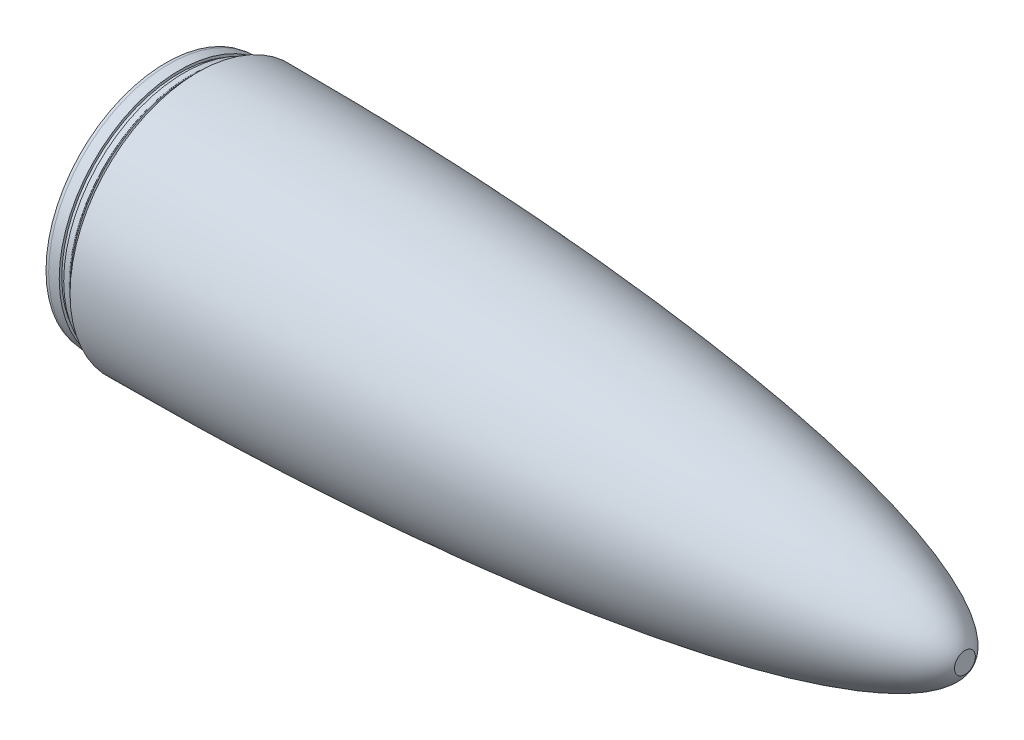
ISO-10303-21;
HEADER;
FILE_DESCRIPTION(('STEP AP214'),'2;1');
FILE_NAME('part.step','',(''),(''),'','','');
FILE_SCHEMA(('AUTOMOTIVE_DESIGN { 1 0 10303 214 1 1 1 1 }'));
ENDSEC;
DATA;
#1=APPLICATION_CONTEXT('core data for automotive mechanical design processes');
#2=APPLICATION_PROTOCOL_DEFINITION('international standard','automotive_design',2000,#1);
#3=PRODUCT_CONTEXT('',#1,'mechanical');
#4=PRODUCT('Part','Part','',(#3));
#5=PRODUCT_RELATED_PRODUCT_CATEGORY('part','',(#4));
#6=PRODUCT_DEFINITION_FORMATION('','',#4);
#7=PRODUCT_DEFINITION_CONTEXT('part definition',#1,'design');
#8=PRODUCT_DEFINITION('design','',#6,#7);
#9=PRODUCT_DEFINITION_SHAPE('','',#8);
#10=(LENGTH_UNIT() NAMED_UNIT(*) SI_UNIT(.MILLI.,.METRE.));
#11=(NAMED_UNIT(*) PLANE_ANGLE_UNIT() SI_UNIT($,.RADIAN.));
#12=(NAMED_UNIT(*) SI_UNIT($,.STERADIAN.) SOLID_ANGLE_UNIT());
#13=UNCERTAINTY_MEASURE_WITH_UNIT(LENGTH_MEASURE(1.E-05),#10,'distance_accuracy_value','');
#14=(GEOMETRIC_REPRESENTATION_CONTEXT(3) GLOBAL_UNCERTAINTY_ASSIGNED_CONTEXT((#13)) GLOBAL_UNIT_ASSIGNED_CONTEXT((#10,
#11,#12)) REPRESENTATION_CONTEXT('',''));
#15=CARTESIAN_POINT('',(0.,0.,0.));
#16=DIRECTION('',(0.,0.,1.));
#17=DIRECTION('',(1.,0.,0.));
#18=AXIS2_PLACEMENT_3D('',#15,#16,#17);
#19=CARTESIAN_POINT('',(-25.4,0.,0.));
#20=DIRECTION('',(-1.,0.,0.));
#21=DIRECTION('',(0.,0.,1.));
#22=AXIS2_PLACEMENT_3D('',#19,#20,#21);
#23=PLANE('',#22);
#24=CARTESIAN_POINT('',(-25.4,0.,0.));
#25=DIRECTION('',(-1.,0.,0.));
#26=DIRECTION('',(0.,0.,1.));
#27=AXIS2_PLACEMENT_3D('',#24,#25,#26);
#28=CIRCLE('',#27,94.996);
#29=CARTESIAN_POINT('',(-25.4,0.,94.996));
#30=VERTEX_POINT('',#29);
#31=EDGE_CURVE('E44',#30,#30,#28,.T.);
#32=ORIENTED_EDGE('',*,*,#31,.T.);
#33=EDGE_LOOP('',(#32));
#34=FACE_BOUND('',#33,.T.);
#35=CARTESIAN_POINT('',(-25.4,0.,0.));
#36=DIRECTION('',(-1.,0.,0.));
#37=DIRECTION('',(0.,0.,1.));
#38=AXIS2_PLACEMENT_3D('',#35,#36,#37);
#39=CIRCLE('',#38,87.63);
#40=CARTESIAN_POINT('',(-25.4,0.,87.63));
#41=VERTEX_POINT('',#40);
#42=EDGE_CURVE('E87',#41,#41,#39,.T.);
#43=ORIENTED_EDGE('',*,*,#42,.F.);
#44=EDGE_LOOP('',(#43));
#45=FACE_BOUND('',#44,.T.);
#46=ADVANCED_FACE('F32',(#34,#45),#23,.T.);
#47=CARTESIAN_POINT('',(577.85,0.,0.));
#48=DIRECTION('',(-1.,0.,0.));
#49=DIRECTION('',(0.,0.,1.));
#50=AXIS2_PLACEMENT_3D('',#47,#48,#49);
#51=PLANE('',#50);
#52=CARTESIAN_POINT('',(577.85,0.,0.));
#53=DIRECTION('',(-1.,0.,0.));
#54=DIRECTION('',(0.,0.,1.));
#55=AXIS2_PLACEMENT_3D('',#52,#53,#54);
#56=CIRCLE('',#55,26.341576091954);
#57=CARTESIAN_POINT('',(577.85,0.,26.341576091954));
#58=VERTEX_POINT('',#57);
#59=EDGE_CURVE('E69',#58,#58,#56,.T.);
#60=ORIENTED_EDGE('',*,*,#59,.T.);
#61=EDGE_LOOP('',(#60));
#62=FACE_BOUND('',#61,.T.);
#63=ADVANCED_FACE('F97',(#62),#51,.T.);
#64=CARTESIAN_POINT('',(0.,0.,0.));
#65=DIRECTION('',(0.,0.,-1.));
#66=DIRECTION('',(1.,0.,0.));
#67=AXIS2_PLACEMENT_3D('',#64,#65,#66);
#68=ELLIPSE('',#67,601.98,93.98);
#69=TRIMMED_CURVE('',#68,(PARAMETER_VALUE(0.)),(PARAMETER_VALUE(3.14159265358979)),.T.,.PARAMETER.);
#70=CARTESIAN_POINT('',(0.,0.,0.));
#71=DIRECTION('',(-1.,0.,0.));
#72=AXIS1_PLACEMENT('',#70,#71);
#73=SURFACE_OF_REVOLUTION('',#69,#72);
#74=CARTESIAN_POINT('',(217.522088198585,0.,0.));
#75=DIRECTION('',(-1.,0.,0.));
#76=DIRECTION('',(0.,0.,1.));
#77=AXIS2_PLACEMENT_3D('',#74,#75,#76);
#78=CIRCLE('',#77,87.63);
#79=CARTESIAN_POINT('',(217.522088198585,0.,87.63));
#80=VERTEX_POINT('',#79);
#81=EDGE_CURVE('E72',#80,#80,#78,.T.);
#82=ORIENTED_EDGE('',*,*,#81,.T.);
#83=EDGE_LOOP('',(#82));
#84=FACE_BOUND('',#83,.T.);
#85=ORIENTED_EDGE('',*,*,#59,.F.);
#86=EDGE_LOOP('',(#85));
#87=FACE_BOUND('',#86,.T.);
#88=ADVANCED_FACE('F92',(#84,#87),#73,.F.);
#89=CARTESIAN_POINT('',(0.,0.,0.));
#90=DIRECTION('',(-1.,0.,0.));
#91=DIRECTION('',(0.,0.,1.));
#92=AXIS2_PLACEMENT_3D('',#89,#90,#91);
#93=CYLINDRICAL_SURFACE('',#92,87.63);
#94=CARTESIAN_POINT('',(165.1,0.,0.));
#95=DIRECTION('',(-1.,0.,0.));
#96=DIRECTION('',(0.,0.,1.));
#97=AXIS2_PLACEMENT_3D('',#94,#95,#96);
#98=CIRCLE('',#97,87.63);
#99=CARTESIAN_POINT('',(165.1,0.,87.63));
#100=VERTEX_POINT('',#99);
#101=EDGE_CURVE('E75',#100,#100,#98,.T.);
#102=ORIENTED_EDGE('',*,*,#101,.T.);
#103=EDGE_LOOP('',(#102));
#104=FACE_BOUND('',#103,.T.);
#105=ORIENTED_EDGE('',*,*,#81,.F.);
#106=EDGE_LOOP('',(#105));
#107=FACE_BOUND('',#106,.T.);
#108=ADVANCED_FACE('F96',(#104,#107),#93,.F.);
#109=CARTESIAN_POINT('',(165.1,0.,0.));
#110=DIRECTION('',(-1.,0.,0.));
#111=DIRECTION('',(0.,0.,1.));
#112=AXIS2_PLACEMENT_3D('',#109,#110,#111);
#113=CONICAL_SURFACE('',#112,87.63,0.756834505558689);
#114=CARTESIAN_POINT('',(160.528,0.,0.));
#115=DIRECTION('',(-1.,0.,0.));
#116=DIRECTION('',(0.,0.,1.));
#117=AXIS2_PLACEMENT_3D('',#114,#115,#116);
#118=CIRCLE('',#117,91.948);
#119=CARTESIAN_POINT('',(160.528,0.,91.948));
#120=VERTEX_POINT('',#119);
#121=EDGE_CURVE('E78',#120,#120,#118,.T.);
#122=ORIENTED_EDGE('',*,*,#121,.T.);
#123=EDGE_LOOP('',(#122));
#124=FACE_BOUND('',#123,.T.);
#125=ORIENTED_EDGE('',*,*,#101,.F.);
#126=EDGE_LOOP('',(#125));
#127=FACE_BOUND('',#126,.T.);
#128=ADVANCED_FACE('F136',(#124,#127),#113,.F.);
#129=CARTESIAN_POINT('',(160.528,0.,0.));
#130=DIRECTION('',(-1.,0.,0.));
#131=DIRECTION('',(0.,0.,1.));
#132=AXIS2_PLACEMENT_3D('',#129,#130,#131);
#133=CONICAL_SURFACE('',#132,91.948,0.0218653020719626);
#134=CARTESIAN_POINT('',(32.766,0.,0.));
#135=DIRECTION('',(-1.,0.,0.));
#136=DIRECTION('',(0.,0.,1.));
#137=AXIS2_PLACEMENT_3D('',#134,#135,#136);
#138=CIRCLE('',#137,94.742);
#139=CARTESIAN_POINT('',(32.766,0.,94.742));
#140=VERTEX_POINT('',#139);
#141=EDGE_CURVE('E81',#140,#140,#138,.T.);
#142=ORIENTED_EDGE('',*,*,#141,.T.);
#143=EDGE_LOOP('',(#142));
#144=FACE_BOUND('',#143,.T.);
#145=ORIENTED_EDGE('',*,*,#121,.F.);
#146=EDGE_LOOP('',(#145));
#147=FACE_BOUND('',#146,.T.);
#148=ADVANCED_FACE('F133',(#144,#147),#133,.F.);
#149=CARTESIAN_POINT('',(32.766,0.,0.));
#150=DIRECTION('',(1.,0.,0.));
#151=DIRECTION('',(0.,0.,-1.));
#152=AXIS2_PLACEMENT_3D('',#149,#150,#151);
#153=CONICAL_SURFACE('',#152,94.742,0.767856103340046);
#154=CARTESIAN_POINT('',(25.4,0.,0.));
#155=DIRECTION('',(-1.,0.,0.));
#156=DIRECTION('',(0.,0.,1.));
#157=AXIS2_PLACEMENT_3D('',#154,#155,#156);
#158=CIRCLE('',#157,87.63);
#159=CARTESIAN_POINT('',(25.4,0.,87.63));
#160=VERTEX_POINT('',#159);
#161=EDGE_CURVE('E84',#160,#160,#158,.T.);
#162=ORIENTED_EDGE('',*,*,#161,.T.);
#163=EDGE_LOOP('',(#162));
#164=FACE_BOUND('',#163,.T.);
#165=ORIENTED_EDGE('',*,*,#141,.F.);
#166=EDGE_LOOP('',(#165));
#167=FACE_BOUND('',#166,.T.);
#168=ADVANCED_FACE('F129',(#164,#167),#153,.F.);
#169=CARTESIAN_POINT('',(0.,0.,0.));
#170=DIRECTION('',(-1.,0.,0.));
#171=DIRECTION('',(0.,0.,1.));
#172=AXIS2_PLACEMENT_3D('',#169,#170,#171);
#173=CYLINDRICAL_SURFACE('',#172,87.63);
#174=ORIENTED_EDGE('',*,*,#161,.F.);
#175=EDGE_LOOP('',(#174));
#176=FACE_BOUND('',#175,.T.);
#177=ORIENTED_EDGE('',*,*,#42,.T.);
#178=EDGE_LOOP('',(#177));
#179=FACE_BOUND('',#178,.T.);
#180=ADVANCED_FACE('F126',(#176,#179),#173,.F.);
#181=CARTESIAN_POINT('',(-6.604,0.,0.));
#182=DIRECTION('',(-1.,0.,0.));
#183=DIRECTION('',(0.,0.,1.));
#184=AXIS2_PLACEMENT_3D('',#181,#182,#183);
#185=CYLINDRICAL_SURFACE('',#184,95.4532);
#186=CARTESIAN_POINT('',(-22.86,0.,0.));
#187=DIRECTION('',(-1.,0.,0.));
#188=DIRECTION('',(0.,0.,1.));
#189=AXIS2_PLACEMENT_3D('',#186,#187,#188);
#190=CIRCLE('',#189,95.4532);
#191=CARTESIAN_POINT('',(-22.86,0.,95.4532));
#192=VERTEX_POINT('',#191);
#193=EDGE_CURVE('E40',#192,#192,#190,.F.);
#194=ORIENTED_EDGE('',*,*,#193,.T.);
#195=EDGE_LOOP('',(#194));
#196=FACE_BOUND('',#195,.T.);
#197=CARTESIAN_POINT('',(-14.478,0.,0.));
#198=DIRECTION('',(-1.,0.,0.));
#199=DIRECTION('',(0.,0.,1.));
#200=AXIS2_PLACEMENT_3D('',#197,#198,#199);
#201=CIRCLE('',#200,95.4532);
#202=CARTESIAN_POINT('',(-14.478,0.,95.4532));
#203=VERTEX_POINT('',#202);
#204=EDGE_CURVE('E63',#203,#203,#201,.F.);
#205=ORIENTED_EDGE('',*,*,#204,.F.);
#206=EDGE_LOOP('',(#205));
#207=FACE_BOUND('',#206,.T.);
#208=ADVANCED_FACE('F115',(#196,#207),#185,.T.);
#209=CARTESIAN_POINT('',(-10.922,0.,0.));
#210=DIRECTION('',(-1.,0.,0.));
#211=DIRECTION('',(0.,0.,1.));
#212=AXIS2_PLACEMENT_3D('',#209,#210,#211);
#213=PLANE('',#212);
#214=CARTESIAN_POINT('',(-10.922,0.,0.));
#215=DIRECTION('',(-1.,0.,0.));
#216=DIRECTION('',(0.,0.,1.));
#217=AXIS2_PLACEMENT_3D('',#214,#215,#216);
#218=CIRCLE('',#217,95.4532);
#219=CARTESIAN_POINT('',(-10.922,0.,95.4532));
#220=VERTEX_POINT('',#219);
#221=EDGE_CURVE('E59',#220,#220,#218,.F.);
#222=ORIENTED_EDGE('',*,*,#221,.F.);
#223=EDGE_LOOP('',(#222));
#224=FACE_BOUND('',#223,.T.);
#225=CARTESIAN_POINT('',(-10.922,0.,0.));
#226=DIRECTION('',(-1.,0.,0.));
#227=DIRECTION('',(0.,0.,1.));
#228=AXIS2_PLACEMENT_3D('',#225,#226,#227);
#229=CIRCLE('',#228,93.4212);
#230=CARTESIAN_POINT('',(-10.922,0.,93.4212));
#231=VERTEX_POINT('',#230);
#232=EDGE_CURVE('E66',#231,#231,#229,.T.);
#233=ORIENTED_EDGE('',*,*,#232,.F.);
#234=EDGE_LOOP('',(#233));
#235=FACE_BOUND('',#234,.T.);
#236=ADVANCED_FACE('F182',(#224,#235),#213,.T.);
#237=CARTESIAN_POINT('',(-14.478,0.,0.));
#238=DIRECTION('',(-1.,0.,0.));
#239=DIRECTION('',(0.,0.,1.));
#240=AXIS2_PLACEMENT_3D('',#237,#238,#239);
#241=PLANE('',#240);
#242=ORIENTED_EDGE('',*,*,#204,.T.);
#243=EDGE_LOOP('',(#242));
#244=FACE_BOUND('',#243,.T.);
#245=CARTESIAN_POINT('',(-14.478,0.,0.));
#246=DIRECTION('',(-1.,0.,0.));
#247=DIRECTION('',(0.,0.,1.));
#248=AXIS2_PLACEMENT_3D('',#245,#246,#247);
#249=CIRCLE('',#248,93.4212);
#250=CARTESIAN_POINT('',(-14.478,0.,93.4212));
#251=VERTEX_POINT('',#250);
#252=EDGE_CURVE('E54',#251,#251,#249,.T.);
#253=ORIENTED_EDGE('',*,*,#252,.T.);
#254=EDGE_LOOP('',(#253));
#255=FACE_BOUND('',#254,.T.);
#256=ADVANCED_FACE('F195',(#244,#255),#241,.F.);
#257=CARTESIAN_POINT('',(-10.922,0.,0.));
#258=DIRECTION('',(-1.,0.,0.));
#259=DIRECTION('',(0.,0.,1.));
#260=AXIS2_PLACEMENT_3D('',#257,#258,#259);
#261=CYLINDRICAL_SURFACE('',#260,93.4212);
#262=ORIENTED_EDGE('',*,*,#232,.T.);
#263=EDGE_LOOP('',(#262));
#264=FACE_BOUND('',#263,.T.);
#265=ORIENTED_EDGE('',*,*,#252,.F.);
#266=EDGE_LOOP('',(#265));
#267=FACE_BOUND('',#266,.T.);
#268=ADVANCED_FACE('F204',(#264,#267),#261,.T.);
#269=CARTESIAN_POINT('',(6.63011312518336E-11,0.,0.));
#270=DIRECTION('',(-1.,0.,0.));
#271=DIRECTION('',(0.,0.,1.));
#272=AXIS2_PLACEMENT_3D('',#269,#270,#271);
#273=CYLINDRICAL_SURFACE('',#272,95.9612);
#274=CARTESIAN_POINT('',(-6.096,0.,0.));
#275=DIRECTION('',(-1.,0.,0.));
#276=DIRECTION('',(0.,0.,1.));
#277=AXIS2_PLACEMENT_3D('',#274,#275,#276);
#278=CIRCLE('',#277,95.9612);
#279=CARTESIAN_POINT('',(-6.096,0.,95.9612));
#280=VERTEX_POINT('',#279);
#281=EDGE_CURVE('E10',#280,#280,#278,.F.);
#282=ORIENTED_EDGE('',*,*,#281,.T.);
#283=EDGE_LOOP('',(#282));
#284=FACE_BOUND('',#283,.T.);
#285=CARTESIAN_POINT('',(-5.334,0.,0.));
#286=DIRECTION('',(-1.,0.,0.));
#287=DIRECTION('',(0.,0.,1.));
#288=AXIS2_PLACEMENT_3D('',#285,#286,#287);
#289=CIRCLE('',#288,95.9612);
#290=CARTESIAN_POINT('',(-5.33399999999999,0.,95.9612));
#291=VERTEX_POINT('',#290);
#292=EDGE_CURVE('E55',#291,#291,#289,.F.);
#293=ORIENTED_EDGE('',*,*,#292,.F.);
#294=EDGE_LOOP('',(#293));
#295=FACE_BOUND('',#294,.T.);
#296=ADVANCED_FACE('F112',(#284,#295),#273,.T.);
#297=CARTESIAN_POINT('',(-6.604,0.,0.));
#298=DIRECTION('',(-1.,0.,0.));
#299=DIRECTION('',(0.,0.,1.));
#300=AXIS2_PLACEMENT_3D('',#297,#298,#299);
#301=CIRCLE('',#300,95.4532);
#302=CARTESIAN_POINT('',(-6.604,0.,95.4532));
#303=VERTEX_POINT('',#302);
#304=EDGE_CURVE('E62',#303,#303,#301,.T.);
#305=ORIENTED_EDGE('',*,*,#304,.T.);
#306=EDGE_LOOP('',(#305));
#307=FACE_BOUND('',#306,.T.);
#308=ORIENTED_EDGE('',*,*,#221,.T.);
#309=EDGE_LOOP('',(#308));
#310=FACE_BOUND('',#309,.T.);
#311=ADVANCED_FACE('F104',(#307,#310),#185,.T.);
#312=CARTESIAN_POINT('',(607.568,0.,0.));
#313=DIRECTION('',(1.,0.,0.));
#314=DIRECTION('',(0.,0.,-1.));
#315=AXIS2_PLACEMENT_3D('',#312,#313,#314);
#316=PLANE('',#315);
#317=CARTESIAN_POINT('',(607.568,0.,0.));
#318=DIRECTION('',(-1.,0.,0.));
#319=DIRECTION('',(0.,0.,1.));
#320=AXIS2_PLACEMENT_3D('',#317,#318,#319);
#321=CIRCLE('',#320,8.26796765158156);
#322=CARTESIAN_POINT('',(607.568,0.,8.26796765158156));
#323=VERTEX_POINT('',#322);
#324=EDGE_CURVE('E48',#323,#323,#321,.T.);
#325=ORIENTED_EDGE('',*,*,#324,.F.);
#326=EDGE_LOOP('',(#325));
#327=FACE_BOUND('',#326,.T.);
#328=ADVANCED_FACE('F102',(#327),#316,.T.);
#329=CARTESIAN_POINT('',(0.,0.,0.));
#330=DIRECTION('',(0.,0.,1.));
#331=DIRECTION('',(1.,0.,0.));
#332=AXIS2_PLACEMENT_3D('',#329,#330,#331);
#333=ELLIPSE('',#332,609.6,101.346);
#334=TRIMMED_CURVE('',#333,(PARAMETER_VALUE(3.14159265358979)),
(PARAMETER_VALUE(6.28318530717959)),.T.,.PARAMETER.);
#335=CARTESIAN_POINT('',(0.,0.,0.));
#336=DIRECTION('',(-1.,0.,0.));
#337=AXIS1_PLACEMENT('',#335,#336);
#338=SURFACE_OF_REVOLUTION('',#334,#337);
#339=ORIENTED_EDGE('',*,*,#324,.T.);
#340=EDGE_LOOP('',(#339));
#341=FACE_BOUND('',#340,.T.);
#342=CARTESIAN_POINT('',(6.63011312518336E-11,0.,0.));
#343=DIRECTION('',(-1.,0.,0.));
#344=DIRECTION('',(0.,0.,1.));
#345=AXIS2_PLACEMENT_3D('',#342,#343,#344);
#346=CIRCLE('',#345,101.346);
#347=CARTESIAN_POINT('',(6.63011312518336E-11,0.,101.346));
#348=VERTEX_POINT('',#347);
#349=EDGE_CURVE('E333',#348,#348,#346,.F.);
#350=ORIENTED_EDGE('',*,*,#349,.T.);
#351=EDGE_LOOP('',(#350));
#352=FACE_BOUND('',#351,.T.);
#353=ADVANCED_FACE('F34',(#341,#352),#338,.F.);
#354=CARTESIAN_POINT('',(6.63011312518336E-11,0.,0.));
#355=DIRECTION('',(-1.,0.,0.));
#356=DIRECTION('',(0.,0.,1.));
#357=AXIS2_PLACEMENT_3D('',#354,#355,#356);
#358=PLANE('',#357);
#359=ORIENTED_EDGE('',*,*,#349,.F.);
#360=EDGE_LOOP('',(#359));
#361=FACE_BOUND('',#360,.T.);
#362=CARTESIAN_POINT('',(6.63011312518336E-11,0.,0.));
#363=DIRECTION('',(-1.,0.,0.));
#364=DIRECTION('',(0.,0.,1.));
#365=AXIS2_PLACEMENT_3D('',#362,#363,#364);
#366=CIRCLE('',#365,95.9612);
#367=CARTESIAN_POINT('',(6.63011312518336E-11,0.,95.9612));
#368=VERTEX_POINT('',#367);
#369=EDGE_CURVE('E330',#368,#368,#366,.T.);
#370=ORIENTED_EDGE('',*,*,#369,.F.);
#371=EDGE_LOOP('',(#370));
#372=FACE_BOUND('',#371,.T.);
#373=ADVANCED_FACE('F110',(#361,#372),#358,.T.);
#374=ORIENTED_EDGE('',*,*,#369,.T.);
#375=EDGE_LOOP('',(#374));
#376=FACE_BOUND('',#375,.T.);
#377=CARTESIAN_POINT('',(-2.032,0.,0.));
#378=DIRECTION('',(-1.,0.,0.));
#379=DIRECTION('',(0.,0.,1.));
#380=AXIS2_PLACEMENT_3D('',#377,#378,#379);
#381=CIRCLE('',#380,95.9612);
#382=CARTESIAN_POINT('',(-2.03199999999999,0.,95.9612));
#383=VERTEX_POINT('',#382);
#384=EDGE_CURVE('E51',#383,#383,#381,.F.);
#385=ORIENTED_EDGE('',*,*,#384,.T.);
#386=EDGE_LOOP('',(#385));
#387=FACE_BOUND('',#386,.T.);
#388=ADVANCED_FACE('F216',(#376,#387),#273,.T.);
#389=CARTESIAN_POINT('',(-3.683,0.,0.));
#390=DIRECTION('',(-1.,0.,0.));
#391=DIRECTION('',(0.,0.,1.));
#392=AXIS2_PLACEMENT_3D('',#389,#390,#391);
#393=TOROIDAL_SURFACE('',#392,95.9612,1.651);
#394=ORIENTED_EDGE('',*,*,#292,.T.);
#395=EDGE_LOOP('',(#394));
#396=FACE_BOUND('',#395,.T.);
#397=CARTESIAN_POINT('',(-3.683,0.,0.));
#398=DIRECTION('',(-1.,0.,0.));
#399=DIRECTION('',(0.,0.,1.));
#400=AXIS2_PLACEMENT_3D('',#397,#398,#399);
#401=CIRCLE('',#400,94.3102);
#402=CARTESIAN_POINT('',(-3.68299999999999,0.,94.3102));
#403=VERTEX_POINT('',#402);
#404=EDGE_CURVE('E58',#403,#403,#401,.F.);
#405=ORIENTED_EDGE('',*,*,#404,.F.);
#406=EDGE_LOOP('',(#405));
#407=FACE_BOUND('',#406,.T.);
#408=ADVANCED_FACE('F222',(#396,#407),#393,.F.);
#409=CARTESIAN_POINT('',(-3.683,0.,0.));
#410=DIRECTION('',(-1.,0.,0.));
#411=DIRECTION('',(0.,0.,1.));
#412=AXIS2_PLACEMENT_3D('',#409,#410,#411);
#413=TOROIDAL_SURFACE('',#412,95.9612,1.651);
#414=ORIENTED_EDGE('',*,*,#384,.F.);
#415=EDGE_LOOP('',(#414));
#416=FACE_BOUND('',#415,.T.);
#417=ORIENTED_EDGE('',*,*,#404,.T.);
#418=EDGE_LOOP('',(#417));
#419=FACE_BOUND('',#418,.T.);
#420=ADVANCED_FACE('F231',(#416,#419),#413,.F.);
#421=CARTESIAN_POINT('',(-25.4,0.,0.));
#422=DIRECTION('',(1.,0.,0.));
#423=DIRECTION('',(0.,0.,-1.));
#424=AXIS2_PLACEMENT_3D('',#421,#422,#423);
#425=CONICAL_SURFACE('',#424,94.996,0.178092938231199);
#426=ORIENTED_EDGE('',*,*,#193,.F.);
#427=EDGE_LOOP('',(#426));
#428=FACE_BOUND('',#427,.T.);
#429=ORIENTED_EDGE('',*,*,#31,.F.);
#430=EDGE_LOOP('',(#429));
#431=FACE_BOUND('',#430,.T.);
#432=ADVANCED_FACE('F240',(#428,#431),#425,.T.);
#433=CARTESIAN_POINT('',(-6.096,0.,0.));
#434=DIRECTION('',(1.,0.,0.));
#435=DIRECTION('',(0.,0.,-1.));
#436=AXIS2_PLACEMENT_3D('',#433,#434,#435);
#437=CONICAL_SURFACE('',#436,95.9612,0.785398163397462);
#438=ORIENTED_EDGE('',*,*,#304,.F.);
#439=EDGE_LOOP('',(#438));
#440=FACE_BOUND('',#439,.T.);
#441=ORIENTED_EDGE('',*,*,#281,.F.);
#442=EDGE_LOOP('',(#441));
#443=FACE_BOUND('',#442,.T.);
#444=ADVANCED_FACE('F249',(#440,#443),#437,.T.);
#445=CLOSED_SHELL('',(#46,#63,#88,#108,#128,#148,#168,#180,#208,#236,#256,#268,#296,#311,#328,
#353,#373,#388,#408,#420,#432,#444));
#446=MANIFOLD_SOLID_BREP('B2',#445);
#447=ADVANCED_BREP_SHAPE_REPRESENTATION('',(#18,#446),#14);
#448=SHAPE_DEFINITION_REPRESENTATION(#9,#447);
ENDSEC;
END-ISO-10303-21;
